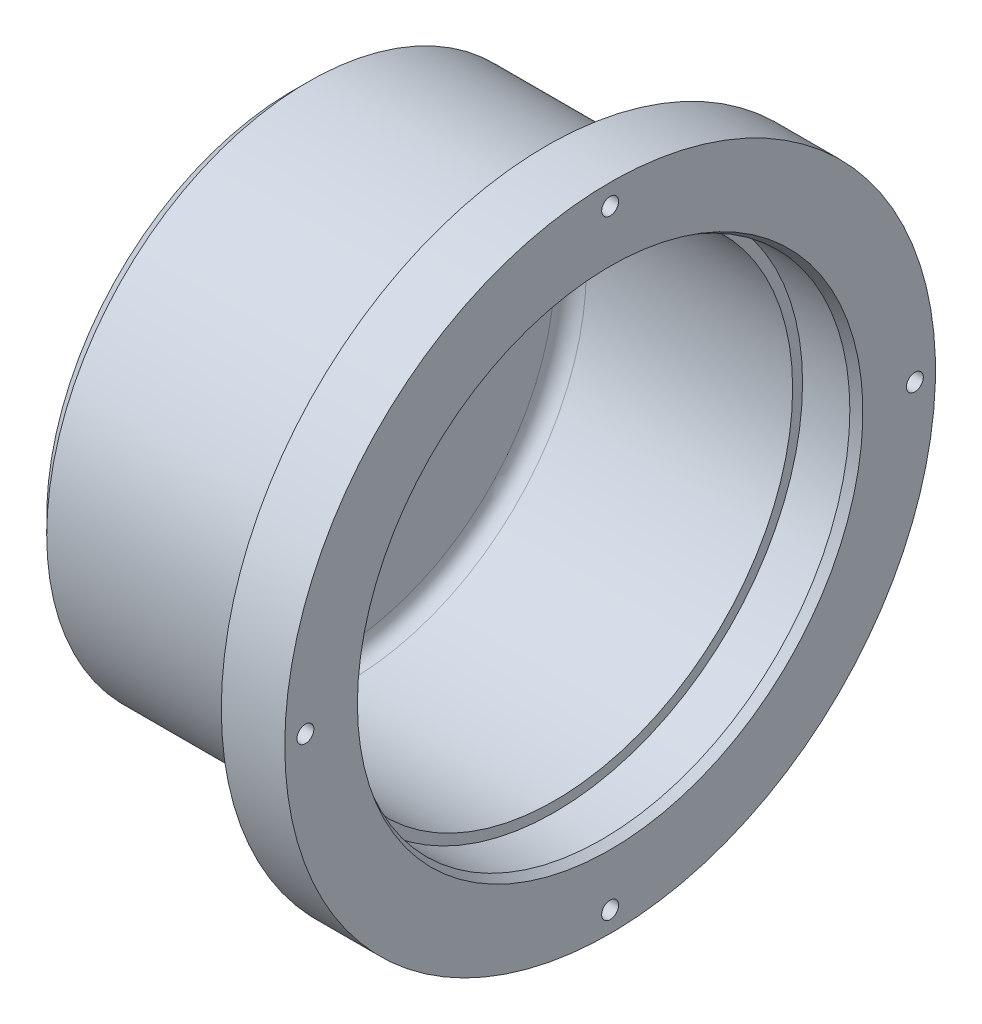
from build123d import *

# Parameters (mm, degrees)
CHAMFER1_SIZE         = 2.54
CHAMFER2_SIZE         = 0.762
CHAMFER2_SIZE2        = 1.319822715
F_6_32_TAPPED_HOLE1_D = 2.7051
CIRPATTERN2_COUNT     = 4
FILLET1_R             = 1.27
FILLET2_R             = 2.54


with BuildPart() as part:
    # Sketch1 → Revolve1 (revolve)
    with BuildSketch(Plane.XY, mode=Mode.PRIVATE) as revolve1_sk:
        Polygon((0, 39.6875), (0, 52.07), (-10.16, 52.07), (-10.16, 41.91), (-50.8, 41.91), (-50.8, 0), (-44.45, 0), (-44.45, 38.1), (-8.89, 38.1), (-8.89, 39.6875), align=None)
    revolve(revolve1_sk.sketch.rotate(Axis((-50.8, 0, 0), (1, 0, 0)), 90), axis=Axis((-50.8, 0, 0), (1, 0, 0)))

    # Chamfer1
    chamfer1_edges = [part.edges().sort_by_distance(p)[0] for p in [
        (-50.8, 0, -41.91),
    ]]
    chamfer(chamfer1_edges, length=CHAMFER1_SIZE)

    # Chamfer2
    chamfer2_edges = [part.edges().sort_by_distance(p)[0] for p in [
        (0, 0, -39.6875),
    ]]
    chamfer2_side = [part.faces().sort_by_distance(p)[0] for p in [
        (0, 0, -41.160262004),
    ]]
    chamfer(chamfer2_edges, length=CHAMFER2_SIZE, length2=CHAMFER2_SIZE2, reference=chamfer2_side[0])

    # Sketch4 → 1_2 NPT Tapped Hole1 (revolve, cut)
    with BuildSketch(Plane(origin=(-50.8, 0, 0), x_dir=(0, 0, 1), z_dir=(0, 1, 0))):
        Polygon((0, 0), (0, 27.970543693), (8.9281, 22.606), (8.9281, 13.462), (9.479726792, 13.462), (9.8827971, 0), align=None)
    revolve(axis=Axis((-57.15, 0, 0), (1, 0, 0)), mode=Mode.SUBTRACT)

    # 6-32 Tapped Hole1 (through all)
    with Locations(Plane(origin=(0, 48.768, 0), x_dir=(0, 0, 1), z_dir=(1, 0, 0))):
        with Locations((0, 0)):
            f_6_32_tapped_hole1 = Hole(F_6_32_TAPPED_HOLE1_D / 2)

    # CirPattern2: 6-32 Tapped Hole1 ×4 about axis
    cirpattern2_axis = Axis((0, 0, 0), (1, 0, 0))
    for i in range(1, CIRPATTERN2_COUNT):
        add(f_6_32_tapped_hole1.rotate(cirpattern2_axis, i * 360 / CIRPATTERN2_COUNT), mode=Mode.SUBTRACT)

    # Fillet1
    fillet1_edges = [part.edges().sort_by_distance(p)[0] for p in [
        (-10.16, 0, -41.91),
    ]]
    fillet(fillet1_edges, radius=FILLET1_R)

    # Fillet2
    fillet2_edges = [part.edges().sort_by_distance(p)[0] for p in [
        (-44.45, 0, -38.1),
    ]]
    fillet(fillet2_edges, radius=FILLET2_R)


solid = part.part
